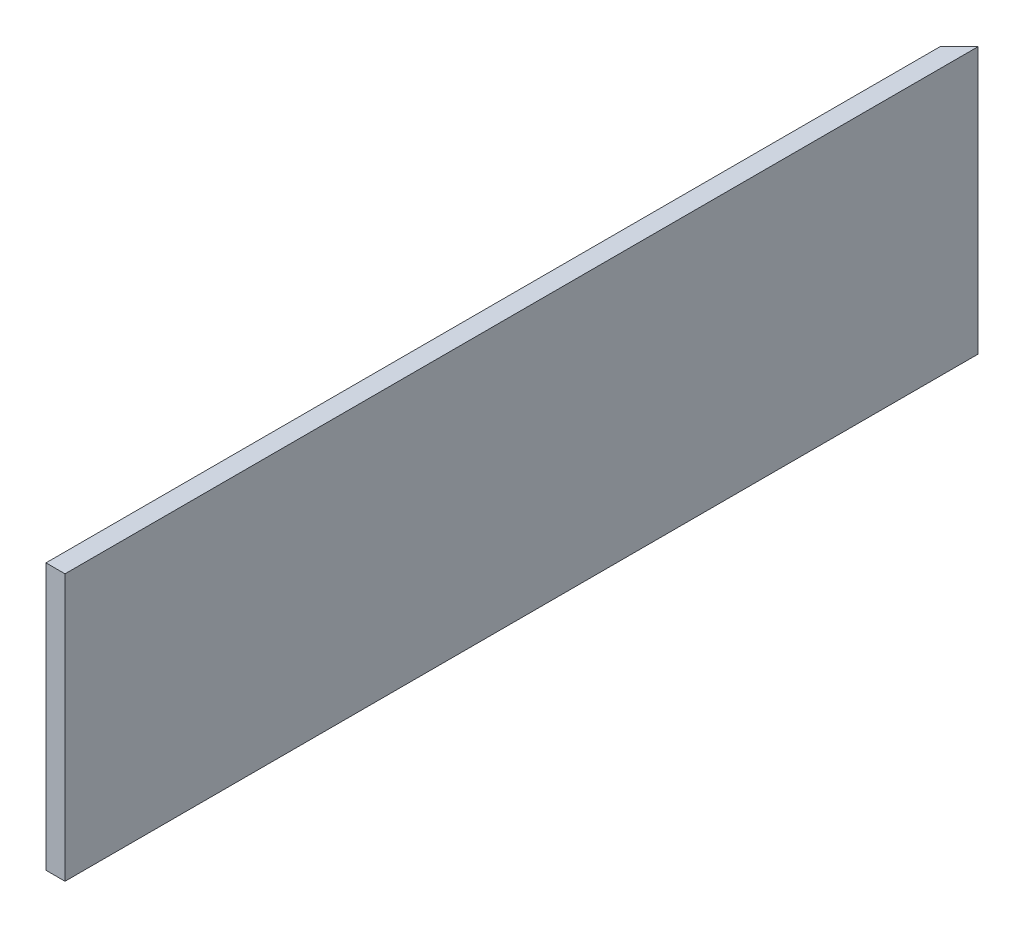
from build123d import *

# Parameters (mm, degrees)
BOSS_EXTRUDE1_DEPTH = 355.6


with BuildPart() as part:
    # Sketch2 → Boss-Extrude1 (new body)
    with BuildSketch(Plane(origin=(0, 0, 0), x_dir=(1, 0, 0), z_dir=(0, 1, 0))):
        Polygon((0, 1193.8), (25.4, 1219.2), (25.4, 1193.8), (25.4, 0), (0, 0), align=None)
    extrude(amount=BOSS_EXTRUDE1_DEPTH)


solid = part.part
